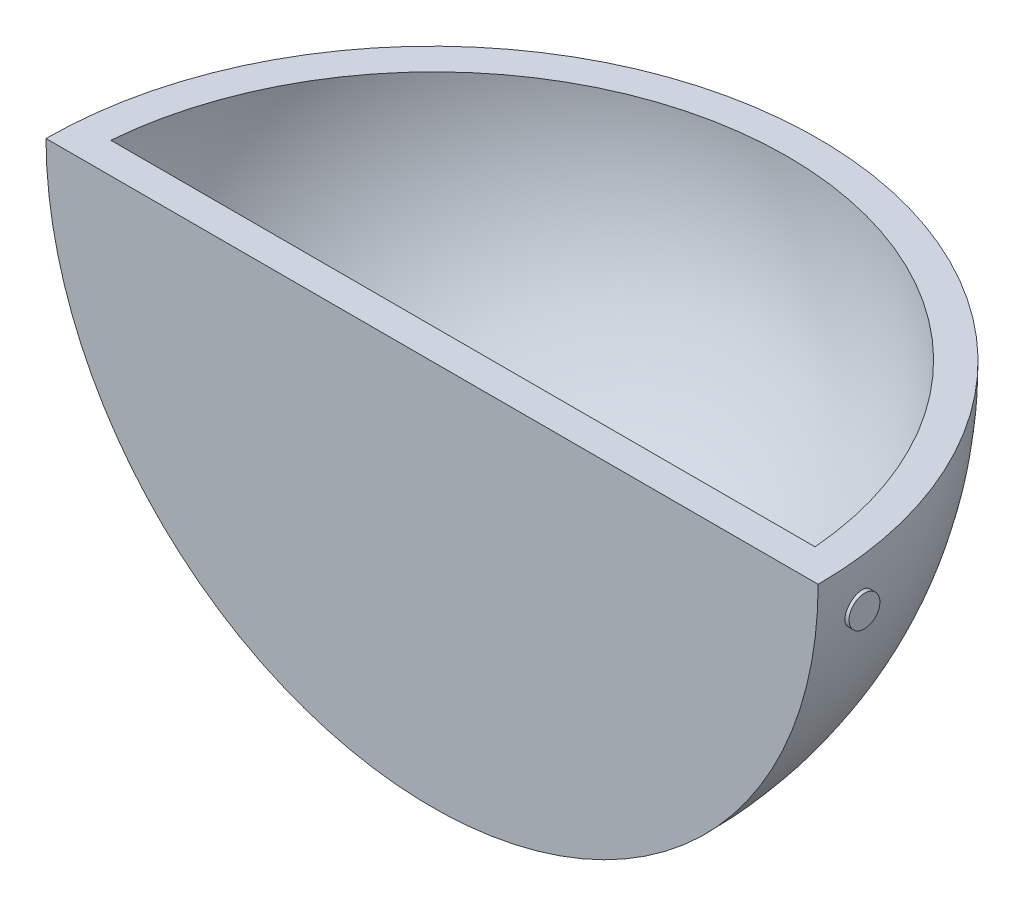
from build123d import *

# Parameters (mm, degrees)
REVOLUCI_N1_ANGLE        = 90
CROQUIS2_R               = 5
SALIENTE_EXTRUIR1_DEPTH  = 250
CORTAR_REVOLUCI_N1_ANGLE = 90


with BuildPart() as part:
    # Croquis1 → Revoluci_n1 (revolve)
    with BuildSketch(Plane.XY):
        with BuildLine():
            Line((0, 0), (250, 0))
            ThreePointArc((250, 0), (125, -125), (0, 0))
        make_face()
    revolve(axis=Axis((0, 0, 0), (1, 0, 0)), revolution_arc=REVOLUCI_N1_ANGLE)

    # Croquis2 → Saliente-Extruir1 (add)
    with BuildSketch(Plane(origin=(0, 0, 0), x_dir=(0, 0, -1), z_dir=(1, 0, 0))):
        with Locations(Location((15, -15, 0), (0, 0, 315))):
            Circle(CROQUIS2_R)
    extrude(amount=SALIENTE_EXTRUIR1_DEPTH)

    # Croquis4 → Cortar-Revoluci_n1 (revolve, cut)
    with BuildSketch(Plane(origin=(0, 0, 0), x_dir=(1, 0, 0), z_dir=(0, 1, 0))):
        with BuildLine():
            Line((11, 10), (239, 10))
            ThreePointArc((239, 10), (125, 115), (11, 10))
        make_face()
    revolve(axis=Axis((11, 0, -10), (-1, 0, 0)), revolution_arc=CORTAR_REVOLUCI_N1_ANGLE, mode=Mode.SUBTRACT)


solid = part.part
